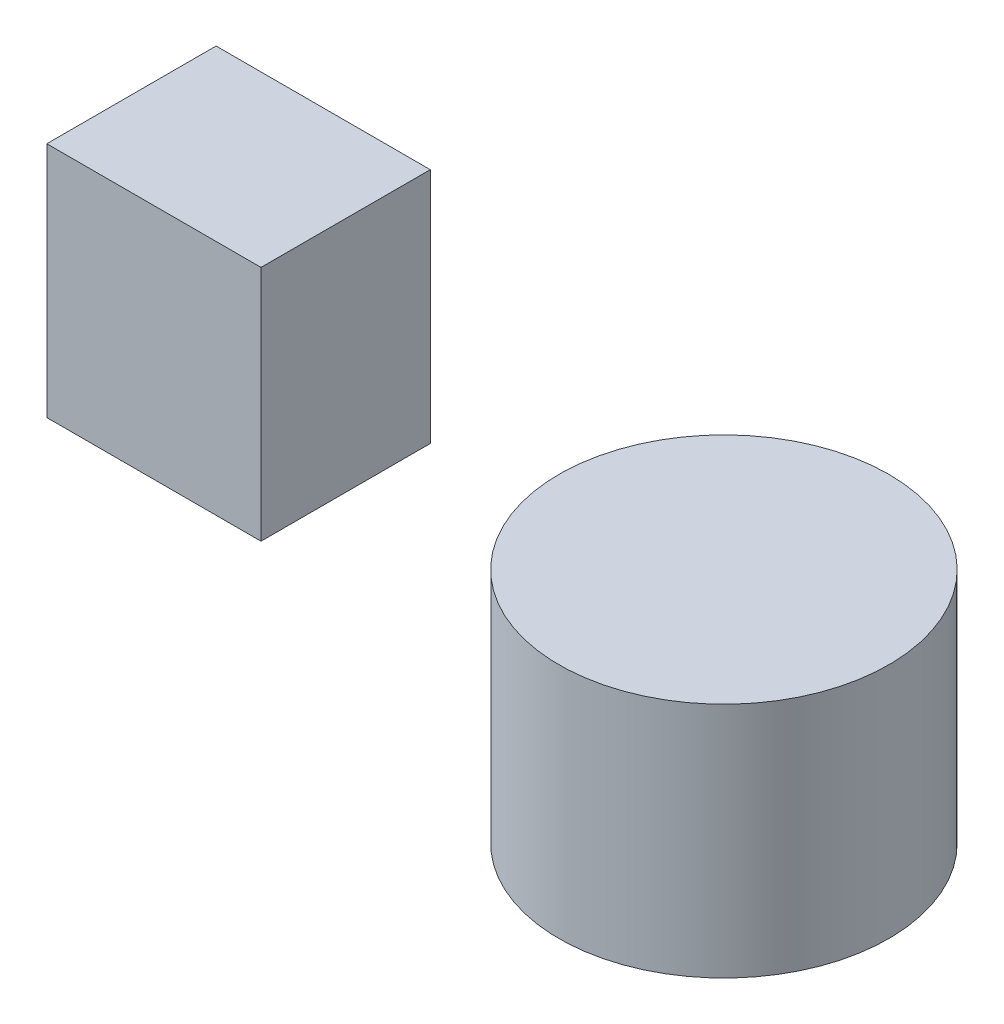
from build123d import *

# Parameters (mm, degrees)
SKETCH1_R             = 36.168111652
BOSS_EXTRUDE1_DEPTH   = 52
SKETCH1_W             = 46.961736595
SKETCH1_H             = 37.114920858
BOSS_EXTRUDE1_2_DEPTH = 52


with BuildPart() as part:
    # Sketch1 → Boss-Extrude1 (new body)
    with BuildSketch(Plane(origin=(0, 0, 0), x_dir=(1, 0, 0), z_dir=(0, 1, 0))):
        with Locations(Location((0, 0, 0), (0, 0, 90))):
            Circle(SKETCH1_R)
    extrude(amount=BOSS_EXTRUDE1_DEPTH)


with BuildPart() as body_2:
    # Sketch1 → Boss-Extrude1 2 (new body)
    with BuildSketch(Plane(origin=(0, 0, 0), x_dir=(1, 0, 0), z_dir=(0, 1, 0))):
        with Locations((-131.606479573, 25.185124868)):
            Rectangle(SKETCH1_W, SKETCH1_H)
    extrude(amount=BOSS_EXTRUDE1_2_DEPTH)


solid = Compound([part.part, body_2.part])
